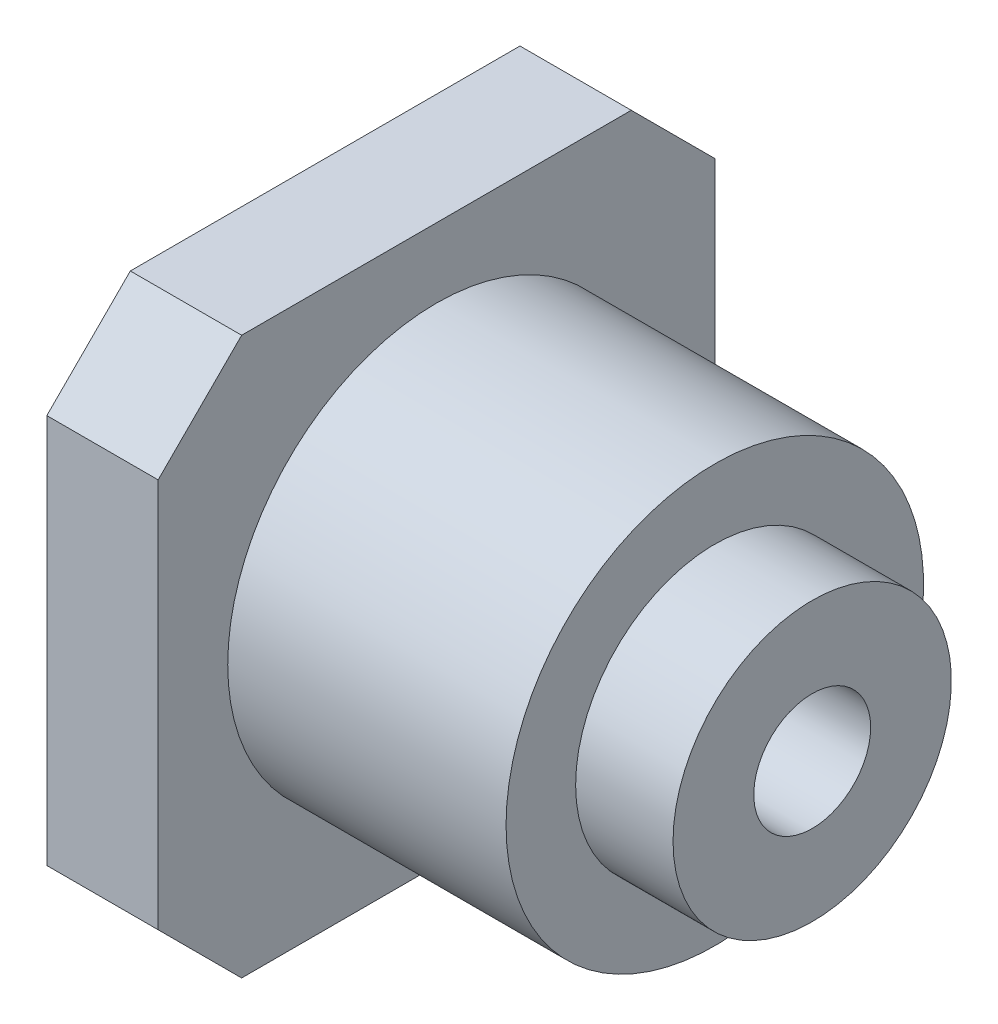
from build123d import *

# Parameters (mm, degrees)
EXTRUDE1_DEPTH    = 4
M5_TAPPED_HOLE1_D = 4.2


with BuildPart() as part:
    # Sketch1 → Revolve1 (revolve)
    with BuildSketch(Plane.XY, mode=Mode.PRIVATE) as revolve1_sk:
        Polygon((0, 0), (17.5, 0), (17.5, 5), (14, 5), (14, 7.5), (0, 7.5), align=None)
    revolve(revolve1_sk.sketch.rotate(Axis((0, 0, 0), (1, 0, 0)), 90), axis=Axis((0, 0, 0), (1, 0, 0)))

    # Sketch2 → Extrude1 (add)
    with BuildSketch(Plane.ZY):
        Polygon((-10, 7), (-7, 10), (7, 10), (10, 7), (10, -7), (7, -10), (-7, -10), (-10, -7), align=None)
    extrude(amount=-EXTRUDE1_DEPTH)

    # M5 Tapped Hole1 (through all)
    with Locations(Plane(origin=(17.5, 0, 0), x_dir=(0, 0, 1), z_dir=(1, 0, 0))):
        with Locations((0, 0)):
            Hole(M5_TAPPED_HOLE1_D / 2)


solid = part.part
